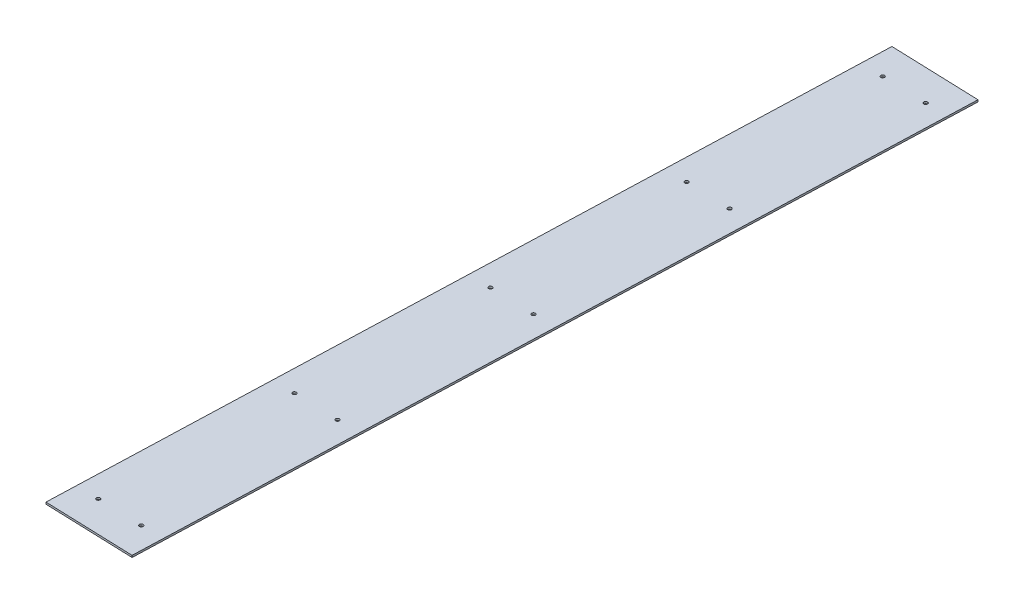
ISO-10303-21;
HEADER;
FILE_DESCRIPTION(('STEP AP214'),'2;1');
FILE_NAME('part.step','',(''),(''),'','','');
FILE_SCHEMA(('AUTOMOTIVE_DESIGN { 1 0 10303 214 1 1 1 1 }'));
ENDSEC;
DATA;
#1=APPLICATION_CONTEXT('core data for automotive mechanical design processes');
#2=APPLICATION_PROTOCOL_DEFINITION('international standard','automotive_design',2000,#1);
#3=PRODUCT_CONTEXT('',#1,'mechanical');
#4=PRODUCT('Part','Part','',(#3));
#5=PRODUCT_RELATED_PRODUCT_CATEGORY('part','',(#4));
#6=PRODUCT_DEFINITION_FORMATION('','',#4);
#7=PRODUCT_DEFINITION_CONTEXT('part definition',#1,'design');
#8=PRODUCT_DEFINITION('design','',#6,#7);
#9=PRODUCT_DEFINITION_SHAPE('','',#8);
#10=(LENGTH_UNIT() NAMED_UNIT(*) SI_UNIT(.MILLI.,.METRE.));
#11=(NAMED_UNIT(*) PLANE_ANGLE_UNIT() SI_UNIT($,.RADIAN.));
#12=(NAMED_UNIT(*) SI_UNIT($,.STERADIAN.) SOLID_ANGLE_UNIT());
#13=UNCERTAINTY_MEASURE_WITH_UNIT(LENGTH_MEASURE(1.E-05),#10,'distance_accuracy_value','');
#14=(GEOMETRIC_REPRESENTATION_CONTEXT(3) GLOBAL_UNCERTAINTY_ASSIGNED_CONTEXT((#13)) GLOBAL_UNIT_ASSIGNED_CONTEXT((#10,
#11,#12)) REPRESENTATION_CONTEXT('',''));
#15=CARTESIAN_POINT('',(0.,0.,0.));
#16=DIRECTION('',(0.,0.,1.));
#17=DIRECTION('',(1.,0.,0.));
#18=AXIS2_PLACEMENT_3D('',#15,#16,#17);
#19=CARTESIAN_POINT('',(0.,-3.2512,0.));
#20=DIRECTION('',(0.,-1.,0.));
#21=DIRECTION('',(1.,0.,0.));
#22=AXIS2_PLACEMENT_3D('',#19,#20,#21);
#23=PLANE('',#22);
#24=CARTESIAN_POINT('',(-744.344463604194,-3.2512,-1126.10029841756));
#25=DIRECTION('',(0.,-1.,0.));
#26=DIRECTION('',(-1.,0.,0.));
#27=AXIS2_PLACEMENT_3D('',#24,#25,#26);
#28=CIRCLE('',#27,1.58749999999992);
#29=CARTESIAN_POINT('',(-745.931963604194,-3.2512,-1126.10029841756));
#30=VERTEX_POINT('',#29);
#31=EDGE_CURVE('E163',#30,#30,#28,.T.);
#32=ORIENTED_EDGE('',*,*,#31,.F.);
#33=EDGE_LOOP('',(#32));
#34=FACE_BOUND('',#33,.T.);
#35=CARTESIAN_POINT('',(-755.594671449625,-3.2512,-802.445767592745));
#36=DIRECTION('',(0.,-1.,0.));
#37=DIRECTION('',(-1.,0.,0.));
#38=AXIS2_PLACEMENT_3D('',#35,#36,#37);
#39=CIRCLE('',#38,1.58750000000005);
#40=CARTESIAN_POINT('',(-757.182171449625,-3.2512,-802.445767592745));
#41=VERTEX_POINT('',#40);
#42=EDGE_CURVE('E151',#41,#41,#39,.T.);
#43=ORIENTED_EDGE('',*,*,#42,.F.);
#44=EDGE_LOOP('',(#43));
#45=FACE_BOUND('',#44,.T.);
#46=CARTESIAN_POINT('',(-782.421467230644,-3.2512,-1127.42385228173));
#47=DIRECTION('',(0.,-1.,0.));
#48=DIRECTION('',(1.,0.,0.));
#49=AXIS2_PLACEMENT_3D('',#46,#47,#48);
#50=CIRCLE('',#49,1.58750000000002);
#51=CARTESIAN_POINT('',(-780.833967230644,-3.2512,-1127.42385228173));
#52=VERTEX_POINT('',#51);
#53=EDGE_CURVE('E139',#52,#52,#50,.T.);
#54=ORIENTED_EDGE('',*,*,#53,.F.);
#55=EDGE_LOOP('',(#54));
#56=FACE_BOUND('',#55,.T.);
#57=CARTESIAN_POINT('',(-793.671675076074,-3.2512,-803.769321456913));
#58=DIRECTION('',(0.,-1.,0.));
#59=DIRECTION('',(1.,0.,0.));
#60=AXIS2_PLACEMENT_3D('',#57,#58,#59);
#61=CIRCLE('',#60,1.58750000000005);
#62=CARTESIAN_POINT('',(-792.084175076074,-3.2512,-803.769321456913));
#63=VERTEX_POINT('',#62);
#64=EDGE_CURVE('E127',#63,#63,#61,.T.);
#65=ORIENTED_EDGE('',*,*,#64,.F.);
#66=EDGE_LOOP('',(#65));
#67=FACE_BOUND('',#66,.T.);
#68=CARTESIAN_POINT('',(-799.296778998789,-3.2512,-641.942056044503));
#69=DIRECTION('',(0.,-1.,0.));
#70=DIRECTION('',(1.,0.,0.));
#71=AXIS2_PLACEMENT_3D('',#68,#69,#70);
#72=CIRCLE('',#71,1.58750000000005);
#73=CARTESIAN_POINT('',(-797.709278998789,-3.2512,-641.942056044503));
#74=VERTEX_POINT('',#73);
#75=EDGE_CURVE('E106',#74,#74,#72,.T.);
#76=ORIENTED_EDGE('',*,*,#75,.F.);
#77=EDGE_LOOP('',(#76));
#78=FACE_BOUND('',#77,.T.);
#79=DIRECTION('',(-0.999396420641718,0.,-0.0347389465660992));
#80=VECTOR('',#79,1.);
#81=CARTESIAN_POINT('',(-819.217650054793,-3.2512,-617.219163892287));
#82=LINE('',#81,#80);
#83=CARTESIAN_POINT('',(-743.063642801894,-3.2512,-614.572056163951));
#84=VERTEX_POINT('',#83);
#85=CARTESIAN_POINT('',(-819.217650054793,-3.2512,-617.219163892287));
#86=VERTEX_POINT('',#85);
#87=EDGE_CURVE('E91',#84,#86,#82,.T.);
#88=ORIENTED_EDGE('',*,*,#87,.T.);
#89=DIRECTION('',(0.034738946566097,0.,-0.999396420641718));
#90=VECTOR('',#89,1.);
#91=CARTESIAN_POINT('',(-794.952495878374,-3.2512,-1315.29756371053));
#92=LINE('',#91,#90);
#93=CARTESIAN_POINT('',(-794.952495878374,-3.2512,-1315.29756371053));
#94=VERTEX_POINT('',#93);
#95=EDGE_CURVE('E86',#86,#94,#92,.T.);
#96=ORIENTED_EDGE('',*,*,#95,.T.);
#97=DIRECTION('',(0.999396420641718,0.,0.0347389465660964));
#98=VECTOR('',#97,1.);
#99=CARTESIAN_POINT('',(-718.798488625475,-3.2512,-1312.65045598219));
#100=LINE('',#99,#98);
#101=CARTESIAN_POINT('',(-718.798488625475,-3.2512,-1312.65045598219));
#102=VERTEX_POINT('',#101);
#103=EDGE_CURVE('E89',#94,#102,#100,.T.);
#104=ORIENTED_EDGE('',*,*,#103,.T.);
#105=DIRECTION('',(-0.0347389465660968,0.,0.999396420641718));
#106=VECTOR('',#105,1.);
#107=CARTESIAN_POINT('',(-718.798488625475,-3.2512,-1312.65045598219));
#108=LINE('',#107,#106);
#109=EDGE_CURVE('E56',#102,#84,#108,.T.);
#110=ORIENTED_EDGE('',*,*,#109,.T.);
#111=EDGE_LOOP('',(#88,#96,#104,#110));
#112=FACE_BOUND('',#111,.T.);
#113=CARTESIAN_POINT('',(-761.21977537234,-3.2512,-640.618502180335));
#114=DIRECTION('',(0.,-1.,0.));
#115=DIRECTION('',(-1.,0.,0.));
#116=AXIS2_PLACEMENT_3D('',#113,#114,#115);
#117=CIRCLE('',#116,1.58750000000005);
#118=CARTESIAN_POINT('',(-762.80727537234,-3.2512,-640.618502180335));
#119=VERTEX_POINT('',#118);
#120=EDGE_CURVE('E121',#119,#119,#117,.T.);
#121=ORIENTED_EDGE('',*,*,#120,.F.);
#122=EDGE_LOOP('',(#121));
#123=FACE_BOUND('',#122,.T.);
#124=CARTESIAN_POINT('',(-788.046571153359,-3.2512,-965.596586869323));
#125=DIRECTION('',(0.,-1.,0.));
#126=DIRECTION('',(1.,0.,0.));
#127=AXIS2_PLACEMENT_3D('',#124,#125,#126);
#128=CIRCLE('',#127,1.58750000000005);
#129=CARTESIAN_POINT('',(-786.459071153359,-3.2512,-965.596586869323));
#130=VERTEX_POINT('',#129);
#131=EDGE_CURVE('E133',#130,#130,#128,.T.);
#132=ORIENTED_EDGE('',*,*,#131,.F.);
#133=EDGE_LOOP('',(#132));
#134=FACE_BOUND('',#133,.T.);
#135=CARTESIAN_POINT('',(-776.796363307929,-3.2512,-1289.25111769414));
#136=DIRECTION('',(0.,-1.,0.));
#137=DIRECTION('',(1.,0.,0.));
#138=AXIS2_PLACEMENT_3D('',#135,#136,#137);
#139=CIRCLE('',#138,1.58750000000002);
#140=CARTESIAN_POINT('',(-775.208863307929,-3.2512,-1289.25111769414));
#141=VERTEX_POINT('',#140);
#142=EDGE_CURVE('E145',#141,#141,#139,.T.);
#143=ORIENTED_EDGE('',*,*,#142,.F.);
#144=EDGE_LOOP('',(#143));
#145=FACE_BOUND('',#144,.T.);
#146=CARTESIAN_POINT('',(-749.969567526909,-3.2512,-964.273033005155));
#147=DIRECTION('',(0.,-1.,0.));
#148=DIRECTION('',(-1.,0.,0.));
#149=AXIS2_PLACEMENT_3D('',#146,#147,#148);
#150=CIRCLE('',#149,1.58750000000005);
#151=CARTESIAN_POINT('',(-751.55706752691,-3.2512,-964.273033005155));
#152=VERTEX_POINT('',#151);
#153=EDGE_CURVE('E157',#152,#152,#150,.T.);
#154=ORIENTED_EDGE('',*,*,#153,.F.);
#155=EDGE_LOOP('',(#154));
#156=FACE_BOUND('',#155,.T.);
#157=CARTESIAN_POINT('',(-738.719359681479,-3.2512,-1287.92756382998));
#158=DIRECTION('',(0.,-1.,0.));
#159=DIRECTION('',(-1.,0.,0.));
#160=AXIS2_PLACEMENT_3D('',#157,#158,#159);
#161=CIRCLE('',#160,1.58750000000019);
#162=CARTESIAN_POINT('',(-740.306859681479,-3.2512,-1287.92756382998));
#163=VERTEX_POINT('',#162);
#164=EDGE_CURVE('E169',#163,#163,#161,.T.);
#165=ORIENTED_EDGE('',*,*,#164,.F.);
#166=EDGE_LOOP('',(#165));
#167=FACE_BOUND('',#166,.T.);
#168=ADVANCED_FACE('F39',(#34,#45,#56,#67,#78,#112,#123,#134,#145,#156,#167),#23,.T.);
#169=CARTESIAN_POINT('',(0.,-1.6256,0.));
#170=DIRECTION('',(0.,-1.,0.));
#171=DIRECTION('',(1.,0.,0.));
#172=AXIS2_PLACEMENT_3D('',#169,#170,#171);
#173=PLANE('',#172);
#174=DIRECTION('',(-0.999396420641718,0.,-0.0347389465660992));
#175=VECTOR('',#174,1.);
#176=CARTESIAN_POINT('',(-819.217650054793,-1.6256,-617.219163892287));
#177=LINE('',#176,#175);
#178=CARTESIAN_POINT('',(-743.063642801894,-1.6256,-614.572056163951));
#179=VERTEX_POINT('',#178);
#180=CARTESIAN_POINT('',(-819.217650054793,-1.6256,-617.219163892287));
#181=VERTEX_POINT('',#180);
#182=EDGE_CURVE('E103',#179,#181,#177,.T.);
#183=ORIENTED_EDGE('',*,*,#182,.F.);
#184=DIRECTION('',(-0.0347389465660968,0.,0.999396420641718));
#185=VECTOR('',#184,1.);
#186=CARTESIAN_POINT('',(-718.798488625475,-1.6256,-1312.65045598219));
#187=LINE('',#186,#185);
#188=CARTESIAN_POINT('',(-718.798488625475,-1.6256,-1312.65045598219));
#189=VERTEX_POINT('',#188);
#190=EDGE_CURVE('E79',#189,#179,#187,.T.);
#191=ORIENTED_EDGE('',*,*,#190,.F.);
#192=DIRECTION('',(0.999396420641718,0.,0.0347389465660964));
#193=VECTOR('',#192,1.);
#194=CARTESIAN_POINT('',(-718.798488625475,-1.6256,-1312.65045598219));
#195=LINE('',#194,#193);
#196=CARTESIAN_POINT('',(-794.952495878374,-1.6256,-1315.29756371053));
#197=VERTEX_POINT('',#196);
#198=EDGE_CURVE('E73',#197,#189,#195,.T.);
#199=ORIENTED_EDGE('',*,*,#198,.F.);
#200=DIRECTION('',(0.034738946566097,0.,-0.999396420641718));
#201=VECTOR('',#200,1.);
#202=CARTESIAN_POINT('',(-794.952495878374,-1.6256,-1315.29756371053));
#203=LINE('',#202,#201);
#204=EDGE_CURVE('E95',#181,#197,#203,.T.);
#205=ORIENTED_EDGE('',*,*,#204,.F.);
#206=EDGE_LOOP('',(#183,#191,#199,#205));
#207=FACE_BOUND('',#206,.T.);
#208=CARTESIAN_POINT('',(-799.296778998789,-1.6256,-641.942056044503));
#209=DIRECTION('',(0.,-1.,0.));
#210=DIRECTION('',(1.,0.,0.));
#211=AXIS2_PLACEMENT_3D('',#208,#209,#210);
#212=CIRCLE('',#211,1.58750000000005);
#213=CARTESIAN_POINT('',(-797.709278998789,-1.6256,-641.942056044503));
#214=VERTEX_POINT('',#213);
#215=EDGE_CURVE('E118',#214,#214,#212,.T.);
#216=ORIENTED_EDGE('',*,*,#215,.T.);
#217=EDGE_LOOP('',(#216));
#218=FACE_BOUND('',#217,.T.);
#219=CARTESIAN_POINT('',(-761.21977537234,-1.6256,-640.618502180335));
#220=DIRECTION('',(0.,-1.,0.));
#221=DIRECTION('',(-1.,0.,0.));
#222=AXIS2_PLACEMENT_3D('',#219,#220,#221);
#223=CIRCLE('',#222,1.58750000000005);
#224=CARTESIAN_POINT('',(-762.80727537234,-1.6256,-640.618502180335));
#225=VERTEX_POINT('',#224);
#226=EDGE_CURVE('E124',#225,#225,#223,.T.);
#227=ORIENTED_EDGE('',*,*,#226,.T.);
#228=EDGE_LOOP('',(#227));
#229=FACE_BOUND('',#228,.T.);
#230=CARTESIAN_POINT('',(-793.671675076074,-1.6256,-803.769321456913));
#231=DIRECTION('',(0.,-1.,0.));
#232=DIRECTION('',(1.,0.,0.));
#233=AXIS2_PLACEMENT_3D('',#230,#231,#232);
#234=CIRCLE('',#233,1.58750000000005);
#235=CARTESIAN_POINT('',(-792.084175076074,-1.6256,-803.769321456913));
#236=VERTEX_POINT('',#235);
#237=EDGE_CURVE('E130',#236,#236,#234,.T.);
#238=ORIENTED_EDGE('',*,*,#237,.T.);
#239=EDGE_LOOP('',(#238));
#240=FACE_BOUND('',#239,.T.);
#241=CARTESIAN_POINT('',(-788.046571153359,-1.6256,-965.596586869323));
#242=DIRECTION('',(0.,-1.,0.));
#243=DIRECTION('',(1.,0.,0.));
#244=AXIS2_PLACEMENT_3D('',#241,#242,#243);
#245=CIRCLE('',#244,1.58750000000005);
#246=CARTESIAN_POINT('',(-786.459071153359,-1.6256,-965.596586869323));
#247=VERTEX_POINT('',#246);
#248=EDGE_CURVE('E136',#247,#247,#245,.T.);
#249=ORIENTED_EDGE('',*,*,#248,.T.);
#250=EDGE_LOOP('',(#249));
#251=FACE_BOUND('',#250,.T.);
#252=CARTESIAN_POINT('',(-782.421467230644,-1.6256,-1127.42385228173));
#253=DIRECTION('',(0.,-1.,0.));
#254=DIRECTION('',(1.,0.,0.));
#255=AXIS2_PLACEMENT_3D('',#252,#253,#254);
#256=CIRCLE('',#255,1.58750000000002);
#257=CARTESIAN_POINT('',(-780.833967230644,-1.6256,-1127.42385228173));
#258=VERTEX_POINT('',#257);
#259=EDGE_CURVE('E142',#258,#258,#256,.T.);
#260=ORIENTED_EDGE('',*,*,#259,.T.);
#261=EDGE_LOOP('',(#260));
#262=FACE_BOUND('',#261,.T.);
#263=CARTESIAN_POINT('',(-776.796363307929,-1.6256,-1289.25111769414));
#264=DIRECTION('',(0.,-1.,0.));
#265=DIRECTION('',(1.,0.,0.));
#266=AXIS2_PLACEMENT_3D('',#263,#264,#265);
#267=CIRCLE('',#266,1.58750000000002);
#268=CARTESIAN_POINT('',(-775.208863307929,-1.6256,-1289.25111769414));
#269=VERTEX_POINT('',#268);
#270=EDGE_CURVE('E148',#269,#269,#267,.T.);
#271=ORIENTED_EDGE('',*,*,#270,.T.);
#272=EDGE_LOOP('',(#271));
#273=FACE_BOUND('',#272,.T.);
#274=CARTESIAN_POINT('',(-755.594671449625,-1.6256,-802.445767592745));
#275=DIRECTION('',(0.,-1.,0.));
#276=DIRECTION('',(-1.,0.,0.));
#277=AXIS2_PLACEMENT_3D('',#274,#275,#276);
#278=CIRCLE('',#277,1.58750000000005);
#279=CARTESIAN_POINT('',(-757.182171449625,-1.6256,-802.445767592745));
#280=VERTEX_POINT('',#279);
#281=EDGE_CURVE('E154',#280,#280,#278,.T.);
#282=ORIENTED_EDGE('',*,*,#281,.T.);
#283=EDGE_LOOP('',(#282));
#284=FACE_BOUND('',#283,.T.);
#285=CARTESIAN_POINT('',(-749.969567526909,-1.6256,-964.273033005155));
#286=DIRECTION('',(0.,-1.,0.));
#287=DIRECTION('',(-1.,0.,0.));
#288=AXIS2_PLACEMENT_3D('',#285,#286,#287);
#289=CIRCLE('',#288,1.58750000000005);
#290=CARTESIAN_POINT('',(-751.55706752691,-1.6256,-964.273033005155));
#291=VERTEX_POINT('',#290);
#292=EDGE_CURVE('E160',#291,#291,#289,.T.);
#293=ORIENTED_EDGE('',*,*,#292,.T.);
#294=EDGE_LOOP('',(#293));
#295=FACE_BOUND('',#294,.T.);
#296=CARTESIAN_POINT('',(-744.344463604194,-1.6256,-1126.10029841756));
#297=DIRECTION('',(0.,-1.,0.));
#298=DIRECTION('',(-1.,0.,0.));
#299=AXIS2_PLACEMENT_3D('',#296,#297,#298);
#300=CIRCLE('',#299,1.58749999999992);
#301=CARTESIAN_POINT('',(-745.931963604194,-1.6256,-1126.10029841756));
#302=VERTEX_POINT('',#301);
#303=EDGE_CURVE('E166',#302,#302,#300,.T.);
#304=ORIENTED_EDGE('',*,*,#303,.T.);
#305=EDGE_LOOP('',(#304));
#306=FACE_BOUND('',#305,.T.);
#307=CARTESIAN_POINT('',(-738.719359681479,-1.6256,-1287.92756382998));
#308=DIRECTION('',(0.,-1.,0.));
#309=DIRECTION('',(-1.,0.,0.));
#310=AXIS2_PLACEMENT_3D('',#307,#308,#309);
#311=CIRCLE('',#310,1.58750000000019);
#312=CARTESIAN_POINT('',(-740.306859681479,-1.6256,-1287.92756382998));
#313=VERTEX_POINT('',#312);
#314=EDGE_CURVE('E172',#313,#313,#311,.T.);
#315=ORIENTED_EDGE('',*,*,#314,.T.);
#316=EDGE_LOOP('',(#315));
#317=FACE_BOUND('',#316,.T.);
#318=ADVANCED_FACE('F114',(#207,#218,#229,#240,#251,#262,#273,#284,#295,#306,#317),#173,.F.);
#319=CARTESIAN_POINT('',(-819.217650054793,-3.2512,-617.219163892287));
#320=DIRECTION('',(0.0347389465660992,0.,-0.999396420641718));
#321=DIRECTION('',(-0.999396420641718,0.,-0.0347389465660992));
#322=AXIS2_PLACEMENT_3D('',#319,#320,#321);
#323=PLANE('',#322);
#324=ORIENTED_EDGE('',*,*,#182,.T.);
#325=DIRECTION('',(0.,1.,0.));
#326=VECTOR('',#325,1.);
#327=CARTESIAN_POINT('',(-819.217650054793,-3.2512,-617.219163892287));
#328=LINE('',#327,#326);
#329=EDGE_CURVE('E11',#86,#181,#328,.T.);
#330=ORIENTED_EDGE('',*,*,#329,.F.);
#331=ORIENTED_EDGE('',*,*,#87,.F.);
#332=DIRECTION('',(0.,1.,0.));
#333=VECTOR('',#332,1.);
#334=CARTESIAN_POINT('',(-743.063642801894,-3.2512,-614.572056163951));
#335=LINE('',#334,#333);
#336=EDGE_CURVE('E99',#84,#179,#335,.T.);
#337=ORIENTED_EDGE('',*,*,#336,.T.);
#338=EDGE_LOOP('',(#324,#330,#331,#337));
#339=FACE_BOUND('',#338,.T.);
#340=ADVANCED_FACE('F41',(#339),#323,.F.);
#341=CARTESIAN_POINT('',(-794.952495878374,-3.2512,-1315.29756371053));
#342=DIRECTION('',(0.999396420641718,0.,0.034738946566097));
#343=DIRECTION('',(0.034738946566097,0.,-0.999396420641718));
#344=AXIS2_PLACEMENT_3D('',#341,#342,#343);
#345=PLANE('',#344);
#346=ORIENTED_EDGE('',*,*,#204,.T.);
#347=DIRECTION('',(0.,1.,0.));
#348=VECTOR('',#347,1.);
#349=CARTESIAN_POINT('',(-794.952495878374,-3.2512,-1315.29756371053));
#350=LINE('',#349,#348);
#351=EDGE_CURVE('E48',#94,#197,#350,.T.);
#352=ORIENTED_EDGE('',*,*,#351,.F.);
#353=ORIENTED_EDGE('',*,*,#95,.F.);
#354=ORIENTED_EDGE('',*,*,#329,.T.);
#355=EDGE_LOOP('',(#346,#352,#353,#354));
#356=FACE_BOUND('',#355,.T.);
#357=ADVANCED_FACE('F94',(#356),#345,.F.);
#358=CARTESIAN_POINT('',(-718.798488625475,-3.2512,-1312.65045598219));
#359=DIRECTION('',(-0.0347389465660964,0.,0.999396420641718));
#360=DIRECTION('',(0.999396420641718,0.,0.0347389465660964));
#361=AXIS2_PLACEMENT_3D('',#358,#359,#360);
#362=PLANE('',#361);
#363=ORIENTED_EDGE('',*,*,#198,.T.);
#364=DIRECTION('',(0.,1.,0.));
#365=VECTOR('',#364,1.);
#366=CARTESIAN_POINT('',(-718.798488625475,-3.2512,-1312.65045598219));
#367=LINE('',#366,#365);
#368=EDGE_CURVE('E96',#102,#189,#367,.T.);
#369=ORIENTED_EDGE('',*,*,#368,.F.);
#370=ORIENTED_EDGE('',*,*,#103,.F.);
#371=ORIENTED_EDGE('',*,*,#351,.T.);
#372=EDGE_LOOP('',(#363,#369,#370,#371));
#373=FACE_BOUND('',#372,.T.);
#374=ADVANCED_FACE('F97',(#373),#362,.F.);
#375=CARTESIAN_POINT('',(-718.798488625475,-3.2512,-1312.65045598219));
#376=DIRECTION('',(-0.999396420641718,0.,-0.0347389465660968));
#377=DIRECTION('',(-0.0347389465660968,0.,0.999396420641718));
#378=AXIS2_PLACEMENT_3D('',#375,#376,#377);
#379=PLANE('',#378);
#380=ORIENTED_EDGE('',*,*,#190,.T.);
#381=ORIENTED_EDGE('',*,*,#336,.F.);
#382=ORIENTED_EDGE('',*,*,#109,.F.);
#383=ORIENTED_EDGE('',*,*,#368,.T.);
#384=EDGE_LOOP('',(#380,#381,#382,#383));
#385=FACE_BOUND('',#384,.T.);
#386=ADVANCED_FACE('F111',(#385),#379,.F.);
#387=CARTESIAN_POINT('',(-799.296778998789,-3.2512,-641.942056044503));
#388=DIRECTION('',(0.,1.,0.));
#389=DIRECTION('',(-1.,0.,0.));
#390=AXIS2_PLACEMENT_3D('',#387,#388,#389);
#391=CYLINDRICAL_SURFACE('',#390,1.58750000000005);
#392=ORIENTED_EDGE('',*,*,#75,.T.);
#393=EDGE_LOOP('',(#392));
#394=FACE_BOUND('',#393,.T.);
#395=ORIENTED_EDGE('',*,*,#215,.F.);
#396=EDGE_LOOP('',(#395));
#397=FACE_BOUND('',#396,.T.);
#398=ADVANCED_FACE('F191',(#394,#397),#391,.F.);
#399=CARTESIAN_POINT('',(-761.21977537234,-3.2512,-640.618502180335));
#400=DIRECTION('',(0.,1.,0.));
#401=DIRECTION('',(-1.,0.,0.));
#402=AXIS2_PLACEMENT_3D('',#399,#400,#401);
#403=CYLINDRICAL_SURFACE('',#402,1.58750000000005);
#404=ORIENTED_EDGE('',*,*,#120,.T.);
#405=EDGE_LOOP('',(#404));
#406=FACE_BOUND('',#405,.T.);
#407=ORIENTED_EDGE('',*,*,#226,.F.);
#408=EDGE_LOOP('',(#407));
#409=FACE_BOUND('',#408,.T.);
#410=ADVANCED_FACE('F236',(#406,#409),#403,.F.);
#411=CARTESIAN_POINT('',(-793.671675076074,-3.2512,-803.769321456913));
#412=DIRECTION('',(0.,1.,0.));
#413=DIRECTION('',(-1.,0.,0.));
#414=AXIS2_PLACEMENT_3D('',#411,#412,#413);
#415=CYLINDRICAL_SURFACE('',#414,1.58750000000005);
#416=ORIENTED_EDGE('',*,*,#64,.T.);
#417=EDGE_LOOP('',(#416));
#418=FACE_BOUND('',#417,.T.);
#419=ORIENTED_EDGE('',*,*,#237,.F.);
#420=EDGE_LOOP('',(#419));
#421=FACE_BOUND('',#420,.T.);
#422=ADVANCED_FACE('F244',(#418,#421),#415,.F.);
#423=CARTESIAN_POINT('',(-788.046571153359,-3.2512,-965.596586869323));
#424=DIRECTION('',(0.,1.,0.));
#425=DIRECTION('',(-1.,0.,0.));
#426=AXIS2_PLACEMENT_3D('',#423,#424,#425);
#427=CYLINDRICAL_SURFACE('',#426,1.58750000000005);
#428=ORIENTED_EDGE('',*,*,#131,.T.);
#429=EDGE_LOOP('',(#428));
#430=FACE_BOUND('',#429,.T.);
#431=ORIENTED_EDGE('',*,*,#248,.F.);
#432=EDGE_LOOP('',(#431));
#433=FACE_BOUND('',#432,.T.);
#434=ADVANCED_FACE('F252',(#430,#433),#427,.F.);
#435=CARTESIAN_POINT('',(-782.421467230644,-3.2512,-1127.42385228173));
#436=DIRECTION('',(0.,1.,0.));
#437=DIRECTION('',(-1.,0.,0.));
#438=AXIS2_PLACEMENT_3D('',#435,#436,#437);
#439=CYLINDRICAL_SURFACE('',#438,1.58750000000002);
#440=ORIENTED_EDGE('',*,*,#53,.T.);
#441=EDGE_LOOP('',(#440));
#442=FACE_BOUND('',#441,.T.);
#443=ORIENTED_EDGE('',*,*,#259,.F.);
#444=EDGE_LOOP('',(#443));
#445=FACE_BOUND('',#444,.T.);
#446=ADVANCED_FACE('F261',(#442,#445),#439,.F.);
#447=CARTESIAN_POINT('',(-776.796363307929,-3.2512,-1289.25111769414));
#448=DIRECTION('',(0.,1.,0.));
#449=DIRECTION('',(-1.,0.,0.));
#450=AXIS2_PLACEMENT_3D('',#447,#448,#449);
#451=CYLINDRICAL_SURFACE('',#450,1.58750000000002);
#452=ORIENTED_EDGE('',*,*,#142,.T.);
#453=EDGE_LOOP('',(#452));
#454=FACE_BOUND('',#453,.T.);
#455=ORIENTED_EDGE('',*,*,#270,.F.);
#456=EDGE_LOOP('',(#455));
#457=FACE_BOUND('',#456,.T.);
#458=ADVANCED_FACE('F270',(#454,#457),#451,.F.);
#459=CARTESIAN_POINT('',(-755.594671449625,-3.2512,-802.445767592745));
#460=DIRECTION('',(0.,1.,0.));
#461=DIRECTION('',(-1.,0.,0.));
#462=AXIS2_PLACEMENT_3D('',#459,#460,#461);
#463=CYLINDRICAL_SURFACE('',#462,1.58750000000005);
#464=ORIENTED_EDGE('',*,*,#42,.T.);
#465=EDGE_LOOP('',(#464));
#466=FACE_BOUND('',#465,.T.);
#467=ORIENTED_EDGE('',*,*,#281,.F.);
#468=EDGE_LOOP('',(#467));
#469=FACE_BOUND('',#468,.T.);
#470=ADVANCED_FACE('F279',(#466,#469),#463,.F.);
#471=CARTESIAN_POINT('',(-749.969567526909,-3.2512,-964.273033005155));
#472=DIRECTION('',(0.,1.,0.));
#473=DIRECTION('',(-1.,0.,0.));
#474=AXIS2_PLACEMENT_3D('',#471,#472,#473);
#475=CYLINDRICAL_SURFACE('',#474,1.58750000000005);
#476=ORIENTED_EDGE('',*,*,#153,.T.);
#477=EDGE_LOOP('',(#476));
#478=FACE_BOUND('',#477,.T.);
#479=ORIENTED_EDGE('',*,*,#292,.F.);
#480=EDGE_LOOP('',(#479));
#481=FACE_BOUND('',#480,.T.);
#482=ADVANCED_FACE('F288',(#478,#481),#475,.F.);
#483=CARTESIAN_POINT('',(-744.344463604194,-3.2512,-1126.10029841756));
#484=DIRECTION('',(0.,1.,0.));
#485=DIRECTION('',(-1.,0.,0.));
#486=AXIS2_PLACEMENT_3D('',#483,#484,#485);
#487=CYLINDRICAL_SURFACE('',#486,1.58749999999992);
#488=ORIENTED_EDGE('',*,*,#31,.T.);
#489=EDGE_LOOP('',(#488));
#490=FACE_BOUND('',#489,.T.);
#491=ORIENTED_EDGE('',*,*,#303,.F.);
#492=EDGE_LOOP('',(#491));
#493=FACE_BOUND('',#492,.T.);
#494=ADVANCED_FACE('F297',(#490,#493),#487,.F.);
#495=CARTESIAN_POINT('',(-738.719359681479,-3.2512,-1287.92756382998));
#496=DIRECTION('',(0.,1.,0.));
#497=DIRECTION('',(-1.,0.,0.));
#498=AXIS2_PLACEMENT_3D('',#495,#496,#497);
#499=CYLINDRICAL_SURFACE('',#498,1.58750000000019);
#500=ORIENTED_EDGE('',*,*,#164,.T.);
#501=EDGE_LOOP('',(#500));
#502=FACE_BOUND('',#501,.T.);
#503=ORIENTED_EDGE('',*,*,#314,.F.);
#504=EDGE_LOOP('',(#503));
#505=FACE_BOUND('',#504,.T.);
#506=ADVANCED_FACE('F178',(#502,#505),#499,.F.);
#507=CLOSED_SHELL('',(#168,#318,#340,#357,#374,#386,#398,#410,#422,#434,#446,#458,#470,#482,
#494,#506));
#508=MANIFOLD_SOLID_BREP('B2',#507);
#509=ADVANCED_BREP_SHAPE_REPRESENTATION('',(#18,#508),#14);
#510=SHAPE_DEFINITION_REPRESENTATION(#9,#509);
ENDSEC;
END-ISO-10303-21;
